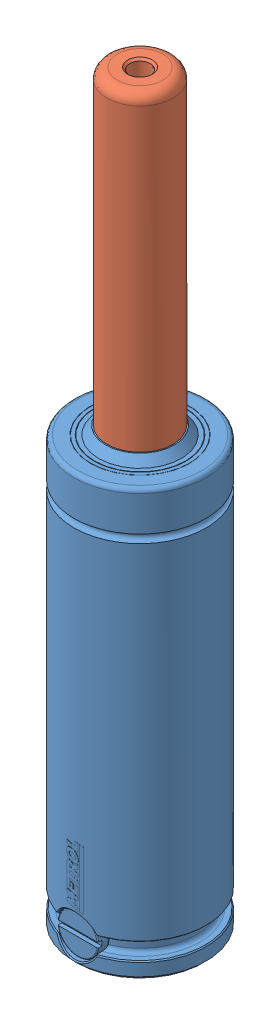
SolidWorks assembly EX360-075.SLDASM, configuration Default (file format 7000). Lengths in mm.
Overall size (32 180 32.1).
2 component instances, 2 part files, 5 mates.
Components (placement in the parent):
- EX0360 Body-1: EX0360 Body.SLDPRT [EX-360-075] x (0 0 1) z (0 -1 0) size (32.1 32 105)
- EX-360 Piston-1: EX-360 Piston.SLDPRT [EX-360-075] at (0 88 0) x (0.318918 0 -0.947782) z (0 -1 0) size (24 24 92)
Mates (geometry in assembly coordinates):
- Concentric1: concentric aligned: cylinder of EX0360 Body-1 through (0 0 0) axis (0 -1 0) radius 8; cylinder of EX-360 Piston-1 through (0 88 0) axis (0 -1 0) radius 8
- LimitDistance1: limit distance anti-aligned: plane of EX0360 Body-1 through (0 93 0) normal (0 -1 0); plane of EX-360 Piston-1 through (11.3734 93 3.827) normal (0 1 0)
- Coincident1: coincident anti-aligned: plane of EX0360 Body-1 through (0 0 0) normal (0 -1 0); plane of assembly through (0 0 0) normal (0 1 0)
- Coincident2: coincident anti-aligned: plane of EX0360 Body-1; plane of assembly through (0 0 0) normal (1 0 0)
- Coincident4: coincident aligned: plane of EX0360 Body-1; plane of assembly through (0 0 0) normal (0 0 1)
